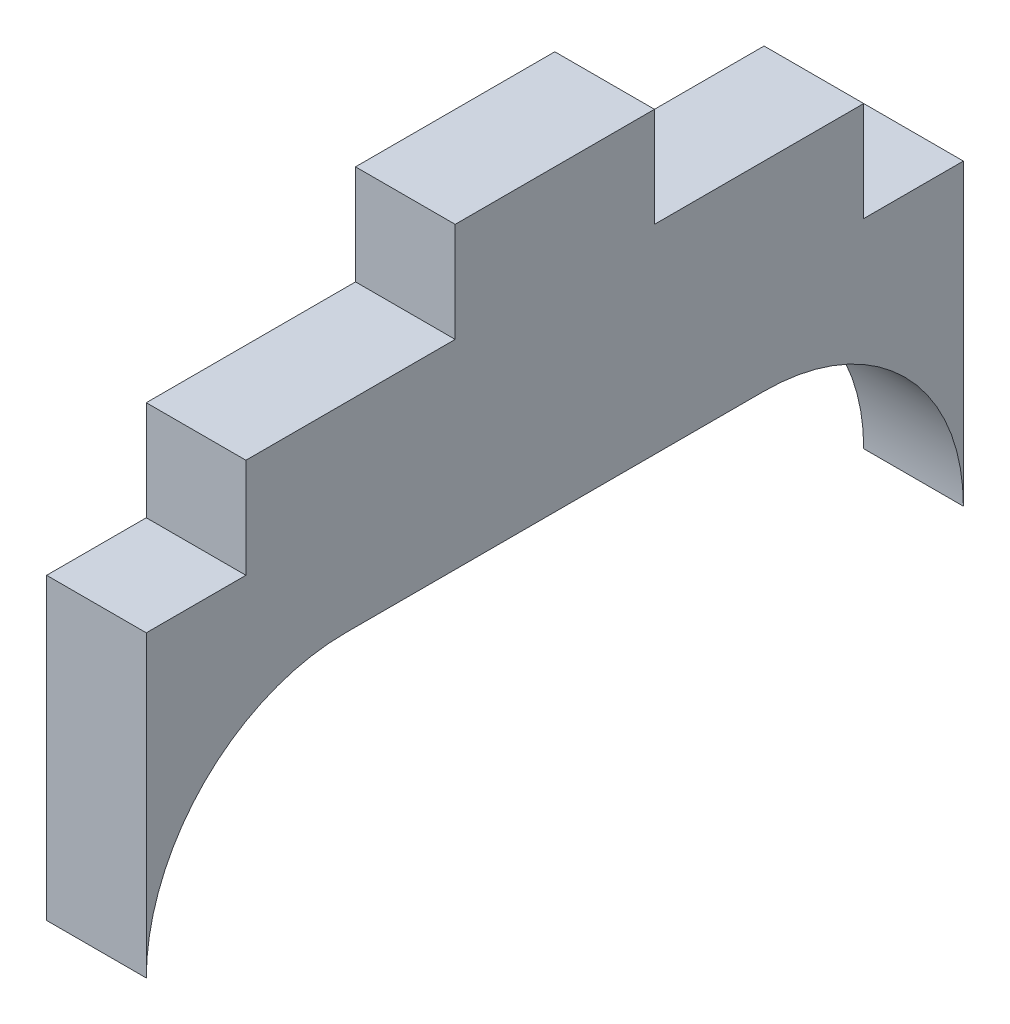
from build123d import *

# Parameters (mm, degrees)
BOSS_EXTRU_1_DEPTH      = 5
ENL_V_MAT_EXTRU_1_REACH = 50.28
ESQUISSE2_W             = 15.5
ESQUISSE2_H             = 5
ENL_V_MAT_EXTRU_2_REACH = 50.28
ESQUISSE3_W             = 5
ESQUISSE3_H             = 5


with BuildPart() as part:
    # Esquisse1 → Boss.-Extru.1 (new body)
    with BuildSketch(Plane(origin=(0, 0, 0), x_dir=(0, 0, -1), z_dir=(1, 0, 0))):
        with BuildLine():
            Line((0, 0), (0, 25))
            Line((0, 25), (41, 25))
            Line((41, 25), (41, 0))
            ThreePointArc((41, 0), (38.071067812, 7.071067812), (31, 10))
            Line((31, 10), (10, 10))
            ThreePointArc((10, 10), (2.928932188, 7.071067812), (0, 0))
        make_face()
    extrude(amount=BOSS_EXTRU_1_DEPTH)

    # Esquisse2 → Enl_v. mat.-Extru.1 (cut, up to next)
    with BuildSketch(Plane(origin=(5, 0, 0), x_dir=(0, 0, -1), z_dir=(1, 0, 0)), mode=Mode.PRIVATE) as enl_v_mat_extru_1_sk1:
        with Locations((7.75, 22.5)):
            Rectangle(ESQUISSE2_W, ESQUISSE2_H)
    enl_v_mat_extru_1_tool1 = extrude(enl_v_mat_extru_1_sk1.sketch, amount=-ENL_V_MAT_EXTRU_1_REACH, mode=Mode.PRIVATE) & part.part
    # Esquisse2 → Enl_v. mat.-Extru.1 (cut, up to next)
    with BuildSketch(Plane(origin=(5, 0, 0), x_dir=(0, 0, -1), z_dir=(1, 0, 0)), mode=Mode.PRIVATE) as enl_v_mat_extru_1_sk2:
        with Locations((33.25, 22.5)):
            Rectangle(ESQUISSE2_W, ESQUISSE2_H)
    enl_v_mat_extru_1_tool2 = extrude(enl_v_mat_extru_1_sk2.sketch, amount=-ENL_V_MAT_EXTRU_1_REACH, mode=Mode.PRIVATE) & part.part
    add(enl_v_mat_extru_1_tool1.solids().sort_by_distance((5, 22.5, -7.75))[0], mode=Mode.SUBTRACT)
    add(enl_v_mat_extru_1_tool2.solids().sort_by_distance((5, 22.5, -33.25))[0], mode=Mode.SUBTRACT)

    # Esquisse3 → Enl_v. mat.-Extru.2 (cut, up to next)
    with BuildSketch(Plane(origin=(5, 0, 0), x_dir=(0, 0, -1), z_dir=(1, 0, 0)), mode=Mode.PRIVATE) as enl_v_mat_extru_2_sk1:
        with Locations((38.5, 17.5)):
            Rectangle(ESQUISSE3_W, ESQUISSE3_H)
    enl_v_mat_extru_2_tool1 = extrude(enl_v_mat_extru_2_sk1.sketch, amount=-ENL_V_MAT_EXTRU_2_REACH, mode=Mode.PRIVATE) & part.part
    # Esquisse3 → Enl_v. mat.-Extru.2 (cut, up to next)
    with BuildSketch(Plane(origin=(5, 0, 0), x_dir=(0, 0, -1), z_dir=(1, 0, 0)), mode=Mode.PRIVATE) as enl_v_mat_extru_2_sk2:
        with Locations((2.5, 17.5)):
            Rectangle(ESQUISSE3_W, ESQUISSE3_H)
    enl_v_mat_extru_2_tool2 = extrude(enl_v_mat_extru_2_sk2.sketch, amount=-ENL_V_MAT_EXTRU_2_REACH, mode=Mode.PRIVATE) & part.part
    add(enl_v_mat_extru_2_tool1.solids().sort_by_distance((5, 17.5, -38.5))[0], mode=Mode.SUBTRACT)
    add(enl_v_mat_extru_2_tool2.solids().sort_by_distance((5, 17.5, -2.5))[0], mode=Mode.SUBTRACT)


solid = part.part
